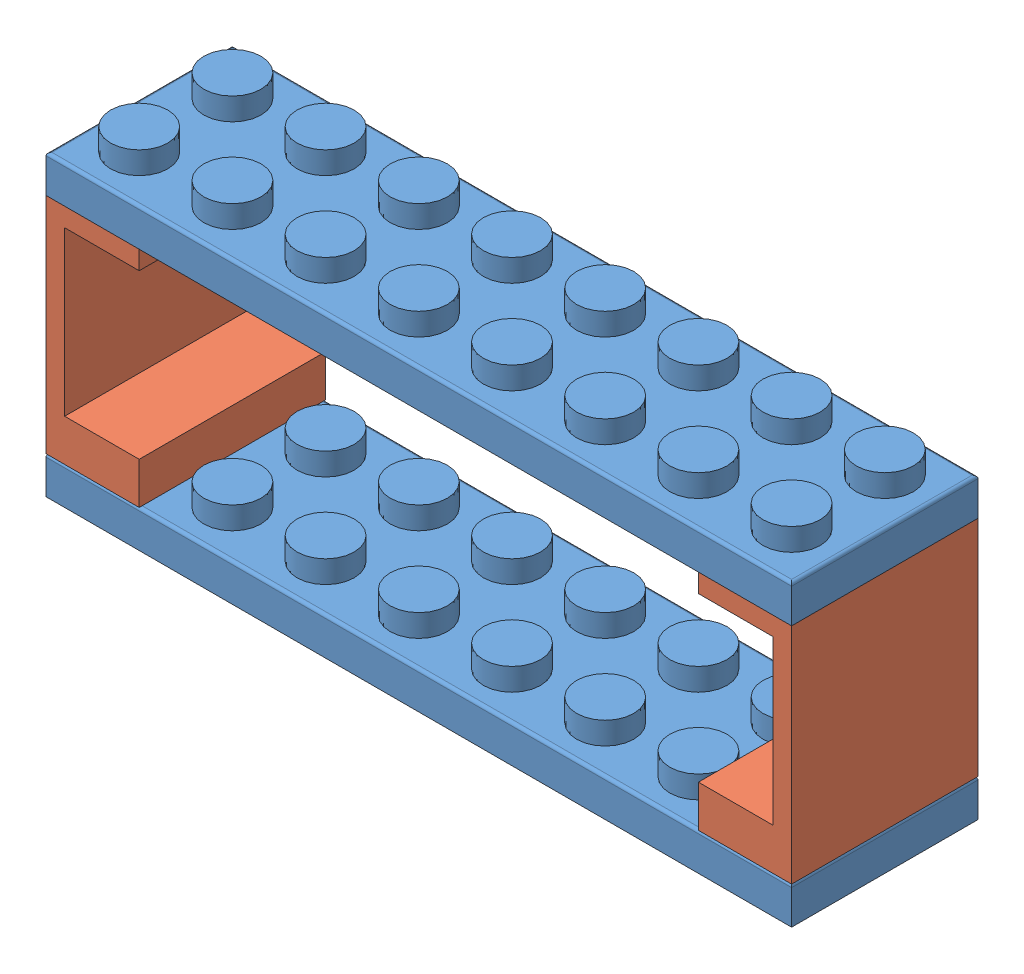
SolidWorks assembly Assem2000.SLDASM, configuration Default (file format 4400). Lengths in mm.
Overall size (63.5 27.3 15.88).
6 component instances, 2 part files, 9 mates.
Components (placement in the parent):
- tailflat.sldprt-1: tailflat.sldprt.SLDASM [Yellow] at origin size (63.5 5.08 15.88)
  - GENERIC LEGO-2: GENERIC LEGO.SLDPRT [8x2 single] at (0 22.225 0) size (63.5 5.08 15.88)
- tailpiece-1: tailpiece.sldprt [2x2 single] at (-27.7812 25.4 0) size (7.94 20.96 15.88)
- tailpiece-2: tailpiece.sldprt [2x2 single] at (27.7812 25.4 0) x (-1 0 0) z (0 0 -1) size (7.94 20.96 15.88)
- tailflat.sldprt-2: tailflat.sldprt.SLDASM [Yellow] at (0 22.225 0) size (63.5 5.08 15.88)
  - GENERIC LEGO-2: GENERIC LEGO.SLDPRT [8x2 single] at (0 22.225 0) size (63.5 5.08 15.88)
Mates (geometry in assembly coordinates):
- Coincident1: coincident aligned: plane of tailflat.sldprt-1/GENERIC LEGO-2 through (31.75 25.4 7.9375) normal (0 0 1); plane of tailpiece-2 through (31.75 44.45 7.9375) normal (0 0 1)
- Coincident2: coincident aligned: plane of tailflat.sldprt-1/GENERIC LEGO-2 through (31.75 25.4 7.9375) normal (1 0 0); plane of tailpiece-2 through (31.75 44.45 7.9375) normal (1 0 0)
- Coincident3: coincident aligned: plane of tailflat.sldprt-1/GENERIC LEGO-2 through (31.75 25.4 7.9375) normal (0 0 1); plane of tailpiece-1 through (-23.8125 44.45 7.9375) normal (0 0 1)
- Coincident4: coincident aligned: plane of tailflat.sldprt-1/GENERIC LEGO-2 through (-31.75 25.4 -7.9375) normal (-1 0 0); plane of tailpiece-1 through (-31.75 44.45 -7.9375) normal (-1 0 0)
- Coincident5: coincident anti-aligned: plane of tailflat.sldprt-1/GENERIC LEGO-2 through (-31.75 25.4 7.9375) normal (0 1 0); plane of tailpiece-1 through (-31.75 25.4 7.9375) normal (0 -1 0)
- Coincident6: coincident anti-aligned: plane of tailflat.sldprt-1/GENERIC LEGO-2 through (-31.75 25.4 7.9375) normal (0 1 0); plane of tailpiece-2 through (31.75 25.4 -7.9375) normal (0 -1 0)
- Coincident7: coincident aligned: plane of tailpiece-2 through (31.75 44.45 7.9375) normal (1 0 0); plane of tailflat.sldprt-2/GENERIC LEGO-2 through (31.75 47.625 7.9375) normal (1 0 0)
- Coincident8: coincident aligned: plane of tailpiece-2 through (31.75 44.45 7.9375) normal (0 0 1); plane of tailflat.sldprt-2/GENERIC LEGO-2 through (31.75 47.625 7.9375) normal (0 0 1)
- Coincident9: coincident anti-aligned: plane of tailpiece-2 through (31.75 44.45 -7.9375) normal (0 1 0); plane of tailflat.sldprt-2/GENERIC LEGO-2 through (-31.75 44.45 7.9375) normal (0 -1 0)
